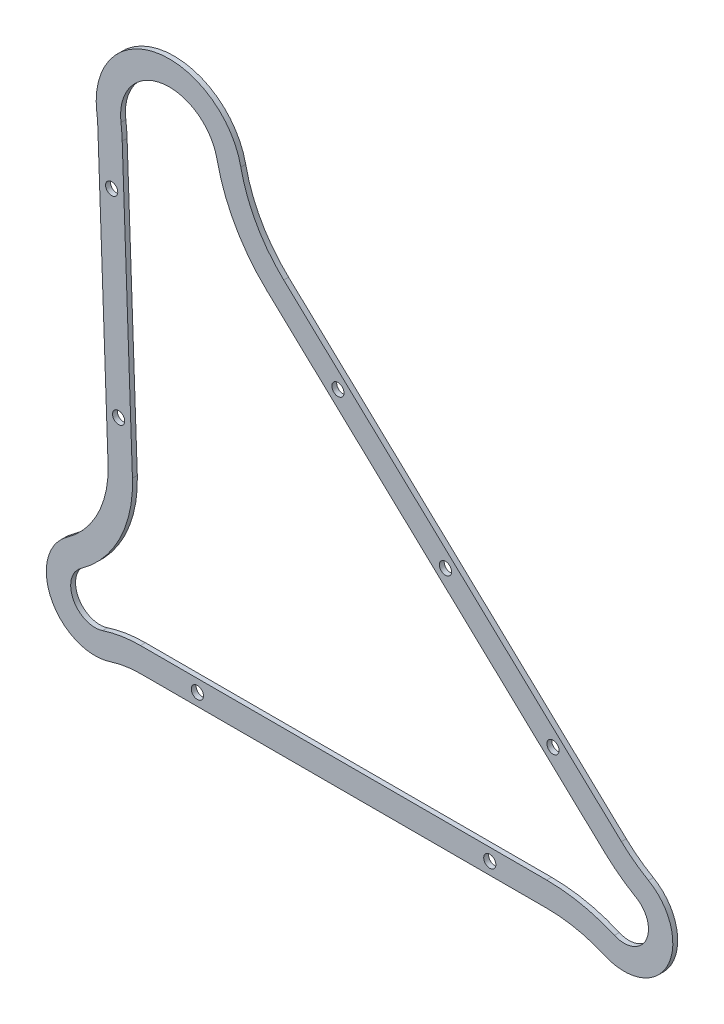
ISO-10303-21;
HEADER;
FILE_DESCRIPTION(('STEP AP214'),'2;1');
FILE_NAME('part.step','',(''),(''),'','','');
FILE_SCHEMA(('AUTOMOTIVE_DESIGN { 1 0 10303 214 1 1 1 1 }'));
ENDSEC;
DATA;
#1=APPLICATION_CONTEXT('core data for automotive mechanical design processes');
#2=APPLICATION_PROTOCOL_DEFINITION('international standard','automotive_design',2000,#1);
#3=PRODUCT_CONTEXT('',#1,'mechanical');
#4=PRODUCT('Part','Part','',(#3));
#5=PRODUCT_RELATED_PRODUCT_CATEGORY('part','',(#4));
#6=PRODUCT_DEFINITION_FORMATION('','',#4);
#7=PRODUCT_DEFINITION_CONTEXT('part definition',#1,'design');
#8=PRODUCT_DEFINITION('design','',#6,#7);
#9=PRODUCT_DEFINITION_SHAPE('','',#8);
#10=(LENGTH_UNIT() NAMED_UNIT(*) SI_UNIT(.MILLI.,.METRE.));
#11=(NAMED_UNIT(*) PLANE_ANGLE_UNIT() SI_UNIT($,.RADIAN.));
#12=(NAMED_UNIT(*) SI_UNIT($,.STERADIAN.) SOLID_ANGLE_UNIT());
#13=UNCERTAINTY_MEASURE_WITH_UNIT(LENGTH_MEASURE(1.E-05),#10,'distance_accuracy_value','');
#14=(GEOMETRIC_REPRESENTATION_CONTEXT(3) GLOBAL_UNCERTAINTY_ASSIGNED_CONTEXT((#13)) GLOBAL_UNIT_ASSIGNED_CONTEXT((#10,
#11,#12)) REPRESENTATION_CONTEXT('',''));
#15=CARTESIAN_POINT('',(0.,0.,0.));
#16=DIRECTION('',(0.,0.,1.));
#17=DIRECTION('',(1.,0.,0.));
#18=AXIS2_PLACEMENT_3D('',#15,#16,#17);
#19=CARTESIAN_POINT('',(65.3082975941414,-204.297699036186,2.54));
#20=DIRECTION('',(0.,0.,1.));
#21=DIRECTION('',(1.,0.,0.));
#22=AXIS2_PLACEMENT_3D('',#19,#20,#21);
#23=PLANE('',#22);
#24=CARTESIAN_POINT('',(-116.75036291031,-121.747699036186,2.54));
#25=DIRECTION('',(0.,0.,1.));
#26=DIRECTION('',(1.,0.,0.));
#27=AXIS2_PLACEMENT_3D('',#24,#25,#26);
#28=CIRCLE('',#27,3.175);
#29=CARTESIAN_POINT('',(-113.57536291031,-121.747699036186,2.54));
#30=VERTEX_POINT('',#29);
#31=EDGE_CURVE('E625',#30,#30,#28,.T.);
#32=ORIENTED_EDGE('',*,*,#31,.F.);
#33=EDGE_LOOP('',(#32));
#34=FACE_BOUND('',#33,.T.);
#35=CARTESIAN_POINT('',(35.6496370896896,-121.747699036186,2.54));
#36=DIRECTION('',(0.,0.,1.));
#37=DIRECTION('',(1.,0.,0.));
#38=AXIS2_PLACEMENT_3D('',#35,#36,#37);
#39=CIRCLE('',#38,3.175);
#40=CARTESIAN_POINT('',(38.8246370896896,-121.747699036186,2.54));
#41=VERTEX_POINT('',#40);
#42=EDGE_CURVE('E627',#41,#41,#39,.T.);
#43=ORIENTED_EDGE('',*,*,#42,.F.);
#44=EDGE_LOOP('',(#43));
#45=FACE_BOUND('',#44,.T.);
#46=CARTESIAN_POINT('',(68.5895734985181,-53.7640875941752,2.54));
#47=DIRECTION('',(0.,0.,1.));
#48=DIRECTION('',(1.,0.,0.));
#49=AXIS2_PLACEMENT_3D('',#46,#47,#48);
#50=CIRCLE('',#49,3.175);
#51=CARTESIAN_POINT('',(71.7645734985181,-53.7640875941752,2.54));
#52=VERTEX_POINT('',#51);
#53=EDGE_CURVE('E635',#52,#52,#50,.T.);
#54=ORIENTED_EDGE('',*,*,#53,.F.);
#55=EDGE_LOOP('',(#54));
#56=FACE_BOUND('',#55,.T.);
#57=CARTESIAN_POINT('',(12.5457813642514,-1.07212379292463,2.54));
#58=DIRECTION('',(0.,0.,1.));
#59=DIRECTION('',(1.,0.,0.));
#60=AXIS2_PLACEMENT_3D('',#57,#58,#59);
#61=CIRCLE('',#60,3.175);
#62=CARTESIAN_POINT('',(15.7207813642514,-1.07212379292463,2.54));
#63=VERTEX_POINT('',#62);
#64=EDGE_CURVE('E641',#63,#63,#61,.T.);
#65=ORIENTED_EDGE('',*,*,#64,.F.);
#66=EDGE_LOOP('',(#65));
#67=FACE_BOUND('',#66,.T.);
#68=CARTESIAN_POINT('',(-43.4980107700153,51.619840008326,2.54));
#69=DIRECTION('',(0.,0.,1.));
#70=DIRECTION('',(1.,0.,0.));
#71=AXIS2_PLACEMENT_3D('',#68,#69,#70);
#72=CIRCLE('',#71,3.175);
#73=CARTESIAN_POINT('',(-40.3230107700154,51.619840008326,2.54));
#74=VERTEX_POINT('',#73);
#75=EDGE_CURVE('E647',#74,#74,#72,.T.);
#76=ORIENTED_EDGE('',*,*,#75,.F.);
#77=EDGE_LOOP('',(#76));
#78=FACE_BOUND('',#77,.T.);
#79=CARTESIAN_POINT('',(-157.790709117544,-18.2212146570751,2.54));
#80=DIRECTION('',(0.,0.,1.));
#81=DIRECTION('',(1.,0.,0.));
#82=AXIS2_PLACEMENT_3D('',#79,#80,#81);
#83=CIRCLE('',#82,3.175);
#84=CARTESIAN_POINT('',(-154.615709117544,-18.2212146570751,2.54));
#85=VERTEX_POINT('',#84);
#86=EDGE_CURVE('E653',#85,#85,#83,.T.);
#87=ORIENTED_EDGE('',*,*,#86,.F.);
#88=EDGE_LOOP('',(#87));
#89=FACE_BOUND('',#88,.T.);
#90=CARTESIAN_POINT('',(-161.411524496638,83.3142456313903,2.54));
#91=DIRECTION('',(0.,0.,1.));
#92=DIRECTION('',(1.,0.,0.));
#93=AXIS2_PLACEMENT_3D('',#90,#91,#92);
#94=CIRCLE('',#93,3.175);
#95=CARTESIAN_POINT('',(-158.236524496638,83.3142456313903,2.54));
#96=VERTEX_POINT('',#95);
#97=EDGE_CURVE('E212',#96,#96,#94,.T.);
#98=ORIENTED_EDGE('',*,*,#97,.F.);
#99=EDGE_LOOP('',(#98));
#100=FACE_BOUND('',#99,.T.);
#101=CARTESIAN_POINT('',(65.3082975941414,-204.297699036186,2.54));
#102=DIRECTION('',(0.,0.,-1.));
#103=DIRECTION('',(1.,0.,0.));
#104=AXIS2_PLACEMENT_3D('',#101,#102,#103);
#105=CIRCLE('',#104,76.2);
#106=CARTESIAN_POINT('',(65.3082975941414,-128.097699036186,2.54));
#107=VERTEX_POINT('',#106);
#108=CARTESIAN_POINT('',(95.5634181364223,-134.361530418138,2.54));
#109=VERTEX_POINT('',#108);
#110=EDGE_CURVE('E308',#107,#109,#105,.T.);
#111=ORIENTED_EDGE('',*,*,#110,.T.);
#112=CARTESIAN_POINT('',(105.648458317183,-111.049474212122,2.54));
#113=DIRECTION('',(0.,0.,1.));
#114=DIRECTION('',(1.,0.,0.));
#115=AXIS2_PLACEMENT_3D('',#112,#113,#114);
#116=CIRCLE('',#115,25.4);
#117=CARTESIAN_POINT('',(118.34776621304,-89.052029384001,2.54));
#118=VERTEX_POINT('',#117);
#119=EDGE_CURVE('E311',#109,#118,#116,.T.);
#120=ORIENTED_EDGE('',*,*,#119,.T.);
#121=CARTESIAN_POINT('',(156.445689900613,-23.0596948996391,2.54));
#122=DIRECTION('',(0.,0.,-1.));
#123=DIRECTION('',(1.,0.,0.));
#124=AXIS2_PLACEMENT_3D('',#121,#122,#123);
#125=CIRCLE('',#124,76.2);
#126=CARTESIAN_POINT('',(104.249868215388,-78.5757844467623,2.54));
#127=VERTEX_POINT('',#126);
#128=EDGE_CURVE('E313',#118,#127,#125,.T.);
#129=ORIENTED_EDGE('',*,*,#128,.T.);
#130=DIRECTION('',(-0.728557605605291,0.684984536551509,0.));
#131=VECTOR('',#130,1.);
#132=CARTESIAN_POINT('',(104.249868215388,-78.5757844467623,2.54));
#133=LINE('',#132,#131);
#134=CARTESIAN_POINT('',(-71.7377864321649,86.8865223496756,2.54));
#135=VERTEX_POINT('',#134);
#136=EDGE_CURVE('E315',#127,#135,#133,.T.);
#137=ORIENTED_EDGE('',*,*,#136,.T.);
#138=CARTESIAN_POINT('',(-19.5419647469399,142.402611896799,2.54));
#139=DIRECTION('',(0.,0.,-1.));
#140=DIRECTION('',(1.,0.,0.));
#141=AXIS2_PLACEMENT_3D('',#138,#139,#140);
#142=CIRCLE('',#141,76.2);
#143=CARTESIAN_POINT('',(-94.1045384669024,126.690750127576,2.54));
#144=VERTEX_POINT('',#143);
#145=EDGE_CURVE('E317',#135,#144,#142,.T.);
#146=ORIENTED_EDGE('',*,*,#145,.T.);
#147=CARTESIAN_POINT('',(-131.385825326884,118.834819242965,2.54));
#148=DIRECTION('',(0.,0.,1.));
#149=DIRECTION('',(1.,0.,0.));
#150=AXIS2_PLACEMENT_3D('',#147,#148,#149);
#151=CIRCLE('',#150,38.1);
#152=CARTESIAN_POINT('',(-169.178577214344,114.005957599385,2.54));
#153=VERTEX_POINT('',#152);
#154=EDGE_CURVE('E319',#144,#153,#151,.T.);
#155=ORIENTED_EDGE('',*,*,#154,.T.);
#156=CARTESIAN_POINT('',(-244.764080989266,104.348234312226,2.54));
#157=DIRECTION('',(0.,0.,-1.));
#158=DIRECTION('',(1.,0.,0.));
#159=AXIS2_PLACEMENT_3D('',#156,#157,#158);
#160=CIRCLE('',#159,76.2);
#161=CARTESIAN_POINT('',(-168.612485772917,107.063845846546,2.54));
#162=VERTEX_POINT('',#161);
#163=EDGE_CURVE('E321',#153,#162,#160,.T.);
#164=ORIENTED_EDGE('',*,*,#163,.T.);
#165=DIRECTION('',(0.0356379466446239,-0.999364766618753,0.));
#166=VECTOR('',#165,1.);
#167=CARTESIAN_POINT('',(-168.612485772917,107.063845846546,2.54));
#168=LINE('',#167,#166);
#169=CARTESIAN_POINT('',(-163.281680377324,-42.4234167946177,2.54));
#170=VERTEX_POINT('',#169);
#171=EDGE_CURVE('E323',#162,#170,#168,.T.);
#172=ORIENTED_EDGE('',*,*,#171,.T.);
#173=CARTESIAN_POINT('',(-214.049410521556,-44.2338244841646,2.54));
#174=DIRECTION('',(0.,0.,-1.));
#175=DIRECTION('',(1.,0.,0.));
#176=AXIS2_PLACEMENT_3D('',#173,#174,#175);
#177=CIRCLE('',#176,50.8);
#178=CARTESIAN_POINT('',(-184.735159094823,-85.7225538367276,2.54));
#179=VERTEX_POINT('',#178);
#180=EDGE_CURVE('E325',#170,#179,#177,.T.);
#181=ORIENTED_EDGE('',*,*,#180,.T.);
#182=CARTESIAN_POINT('',(-170.078033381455,-106.466918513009,2.54));
#183=DIRECTION('',(0.,0.,1.));
#184=DIRECTION('',(1.,0.,0.));
#185=AXIS2_PLACEMENT_3D('',#182,#183,#184);
#186=CIRCLE('',#185,25.4);
#187=CARTESIAN_POINT('',(-162.188363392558,-130.610512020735,2.54));
#188=VERTEX_POINT('',#187);
#189=EDGE_CURVE('E327',#179,#188,#186,.T.);
#190=ORIENTED_EDGE('',*,*,#189,.T.);
#191=CARTESIAN_POINT('',(-146.409023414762,-178.897699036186,2.54));
#192=DIRECTION('',(0.,0.,-1.));
#193=DIRECTION('',(1.,0.,0.));
#194=AXIS2_PLACEMENT_3D('',#191,#192,#193);
#195=CIRCLE('',#194,50.8);
#196=CARTESIAN_POINT('',(-146.409023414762,-128.097699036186,2.54));
#197=VERTEX_POINT('',#196);
#198=EDGE_CURVE('E329',#188,#197,#195,.T.);
#199=ORIENTED_EDGE('',*,*,#198,.T.);
#200=DIRECTION('',(1.,0.,0.));
#201=VECTOR('',#200,1.);
#202=CARTESIAN_POINT('',(-146.409023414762,-128.097699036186,2.54));
#203=LINE('',#202,#201);
#204=EDGE_CURVE('E331',#197,#107,#203,.T.);
#205=ORIENTED_EDGE('',*,*,#204,.T.);
#206=EDGE_LOOP('',(#111,#120,#129,#137,#146,#155,#164,#172,#181,#190,#199,#205));
#207=FACE_BOUND('',#206,.T.);
#208=DIRECTION('',(1.,0.,0.));
#209=VECTOR('',#208,1.);
#210=CARTESIAN_POINT('',(-146.409023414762,-115.397699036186,2.54));
#211=LINE('',#210,#209);
#212=CARTESIAN_POINT('',(-146.409023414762,-115.397699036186,2.54));
#213=VERTEX_POINT('',#212);
#214=CARTESIAN_POINT('',(65.3082975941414,-115.397699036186,2.54));
#215=VERTEX_POINT('',#214);
#216=EDGE_CURVE('E242',#213,#215,#211,.T.);
#217=ORIENTED_EDGE('',*,*,#216,.F.);
#218=CARTESIAN_POINT('',(-146.409023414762,-178.897699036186,2.54));
#219=DIRECTION('',(0.,0.,-1.));
#220=DIRECTION('',(1.,0.,0.));
#221=AXIS2_PLACEMENT_3D('',#218,#219,#220);
#222=CIRCLE('',#221,63.5);
#223=CARTESIAN_POINT('',(-166.133198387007,-118.538715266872,2.54));
#224=VERTEX_POINT('',#223);
#225=EDGE_CURVE('E202',#224,#213,#222,.T.);
#226=ORIENTED_EDGE('',*,*,#225,.F.);
#227=CARTESIAN_POINT('',(-170.078033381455,-106.466918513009,2.54));
#228=DIRECTION('',(0.,0.,1.));
#229=DIRECTION('',(1.,0.,0.));
#230=AXIS2_PLACEMENT_3D('',#227,#228,#229);
#231=CIRCLE('',#230,12.7);
#232=CARTESIAN_POINT('',(-177.406596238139,-96.0947361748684,2.54));
#233=VERTEX_POINT('',#232);
#234=EDGE_CURVE('E262',#233,#224,#231,.T.);
#235=ORIENTED_EDGE('',*,*,#234,.F.);
#236=CARTESIAN_POINT('',(-214.049410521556,-44.2338244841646,2.54));
#237=DIRECTION('',(0.,0.,-1.));
#238=DIRECTION('',(1.,0.,0.));
#239=AXIS2_PLACEMENT_3D('',#236,#237,#238);
#240=CIRCLE('',#239,63.5);
#241=CARTESIAN_POINT('',(-150.589747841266,-41.970814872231,2.54));
#242=VERTEX_POINT('',#241);
#243=EDGE_CURVE('E260',#242,#233,#240,.T.);
#244=ORIENTED_EDGE('',*,*,#243,.F.);
#245=DIRECTION('',(0.0356379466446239,-0.999364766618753,0.));
#246=VECTOR('',#245,1.);
#247=CARTESIAN_POINT('',(-155.920553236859,107.516447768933,2.54));
#248=LINE('',#247,#246);
#249=CARTESIAN_POINT('',(-155.920553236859,107.516447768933,2.54));
#250=VERTEX_POINT('',#249);
#251=EDGE_CURVE('E258',#250,#242,#248,.T.);
#252=ORIENTED_EDGE('',*,*,#251,.F.);
#253=CARTESIAN_POINT('',(-244.764080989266,104.348234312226,2.54));
#254=DIRECTION('',(0.,0.,-1.));
#255=DIRECTION('',(1.,0.,0.));
#256=AXIS2_PLACEMENT_3D('',#253,#254,#255);
#257=CIRCLE('',#256,88.9);
#258=CARTESIAN_POINT('',(-156.580993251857,115.615578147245,2.54));
#259=VERTEX_POINT('',#258);
#260=EDGE_CURVE('E256',#259,#250,#257,.T.);
#261=ORIENTED_EDGE('',*,*,#260,.F.);
#262=CARTESIAN_POINT('',(-131.385825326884,118.834819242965,2.54));
#263=DIRECTION('',(0.,0.,1.));
#264=DIRECTION('',(1.,0.,0.));
#265=AXIS2_PLACEMENT_3D('',#262,#263,#264);
#266=CIRCLE('',#265,25.4);
#267=CARTESIAN_POINT('',(-106.531634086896,124.072106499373,2.54));
#268=VERTEX_POINT('',#267);
#269=EDGE_CURVE('E254',#268,#259,#266,.T.);
#270=ORIENTED_EDGE('',*,*,#269,.F.);
#271=CARTESIAN_POINT('',(-19.5419647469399,142.402611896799,2.54));
#272=DIRECTION('',(0.,0.,-1.));
#273=DIRECTION('',(1.,0.,0.));
#274=AXIS2_PLACEMENT_3D('',#271,#272,#273);
#275=CIRCLE('',#274,88.9);
#276=CARTESIAN_POINT('',(-80.4370900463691,77.6338407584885,2.54));
#277=VERTEX_POINT('',#276);
#278=EDGE_CURVE('E252',#277,#268,#275,.T.);
#279=ORIENTED_EDGE('',*,*,#278,.F.);
#280=DIRECTION('',(-0.728557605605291,0.684984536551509,0.));
#281=VECTOR('',#280,1.);
#282=CARTESIAN_POINT('',(95.5505646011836,-87.8284660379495,2.54));
#283=LINE('',#282,#281);
#284=CARTESIAN_POINT('',(95.5505646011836,-87.8284660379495,2.54));
#285=VERTEX_POINT('',#284);
#286=EDGE_CURVE('E250',#285,#277,#283,.T.);
#287=ORIENTED_EDGE('',*,*,#286,.F.);
#288=CARTESIAN_POINT('',(156.445689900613,-23.0596948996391,2.54));
#289=DIRECTION('',(0.,0.,-1.));
#290=DIRECTION('',(1.,0.,0.));
#291=AXIS2_PLACEMENT_3D('',#288,#289,#290);
#292=CIRCLE('',#291,88.9);
#293=CARTESIAN_POINT('',(111.998112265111,-100.050751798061,2.54));
#294=VERTEX_POINT('',#293);
#295=EDGE_CURVE('E248',#294,#285,#292,.T.);
#296=ORIENTED_EDGE('',*,*,#295,.F.);
#297=CARTESIAN_POINT('',(105.648458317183,-111.049474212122,2.54));
#298=DIRECTION('',(0.,0.,1.));
#299=DIRECTION('',(1.,0.,0.));
#300=AXIS2_PLACEMENT_3D('',#297,#298,#299);
#301=CIRCLE('',#300,12.7);
#302=CARTESIAN_POINT('',(100.605938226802,-122.70550231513,2.54));
#303=VERTEX_POINT('',#302);
#304=EDGE_CURVE('E246',#303,#294,#301,.T.);
#305=ORIENTED_EDGE('',*,*,#304,.F.);
#306=CARTESIAN_POINT('',(65.3082975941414,-204.297699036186,2.54));
#307=DIRECTION('',(0.,0.,-1.));
#308=DIRECTION('',(1.,0.,0.));
#309=AXIS2_PLACEMENT_3D('',#306,#307,#308);
#310=CIRCLE('',#309,88.9);
#311=EDGE_CURVE('E244',#215,#303,#310,.T.);
#312=ORIENTED_EDGE('',*,*,#311,.F.);
#313=EDGE_LOOP('',(#217,#226,#235,#244,#252,#261,#270,#279,#287,#296,#305,#312));
#314=FACE_BOUND('',#313,.T.);
#315=ADVANCED_FACE('F26',(#34,#45,#56,#67,#78,#89,#100,#207,#314),#23,.T.);
#316=CARTESIAN_POINT('',(65.3082975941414,-204.297699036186,0.));
#317=DIRECTION('',(0.,0.,1.));
#318=DIRECTION('',(1.,0.,0.));
#319=AXIS2_PLACEMENT_3D('',#316,#317,#318);
#320=PLANE('',#319);
#321=CARTESIAN_POINT('',(-116.75036291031,-121.747699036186,0.));
#322=DIRECTION('',(0.,0.,1.));
#323=DIRECTION('',(1.,0.,0.));
#324=AXIS2_PLACEMENT_3D('',#321,#322,#323);
#325=CIRCLE('',#324,3.175);
#326=CARTESIAN_POINT('',(-113.57536291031,-121.747699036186,0.));
#327=VERTEX_POINT('',#326);
#328=EDGE_CURVE('E623',#327,#327,#325,.T.);
#329=ORIENTED_EDGE('',*,*,#328,.T.);
#330=EDGE_LOOP('',(#329));
#331=FACE_BOUND('',#330,.T.);
#332=CARTESIAN_POINT('',(35.6496370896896,-121.747699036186,0.));
#333=DIRECTION('',(0.,0.,1.));
#334=DIRECTION('',(1.,0.,0.));
#335=AXIS2_PLACEMENT_3D('',#332,#333,#334);
#336=CIRCLE('',#335,3.175);
#337=CARTESIAN_POINT('',(38.8246370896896,-121.747699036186,0.));
#338=VERTEX_POINT('',#337);
#339=EDGE_CURVE('E632',#338,#338,#336,.T.);
#340=ORIENTED_EDGE('',*,*,#339,.T.);
#341=EDGE_LOOP('',(#340));
#342=FACE_BOUND('',#341,.T.);
#343=CARTESIAN_POINT('',(68.5895734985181,-53.7640875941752,0.));
#344=DIRECTION('',(0.,0.,1.));
#345=DIRECTION('',(1.,0.,0.));
#346=AXIS2_PLACEMENT_3D('',#343,#344,#345);
#347=CIRCLE('',#346,3.175);
#348=CARTESIAN_POINT('',(71.7645734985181,-53.7640875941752,0.));
#349=VERTEX_POINT('',#348);
#350=EDGE_CURVE('E638',#349,#349,#347,.T.);
#351=ORIENTED_EDGE('',*,*,#350,.T.);
#352=EDGE_LOOP('',(#351));
#353=FACE_BOUND('',#352,.T.);
#354=CARTESIAN_POINT('',(12.5457813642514,-1.07212379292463,0.));
#355=DIRECTION('',(0.,0.,1.));
#356=DIRECTION('',(1.,0.,0.));
#357=AXIS2_PLACEMENT_3D('',#354,#355,#356);
#358=CIRCLE('',#357,3.175);
#359=CARTESIAN_POINT('',(15.7207813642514,-1.07212379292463,0.));
#360=VERTEX_POINT('',#359);
#361=EDGE_CURVE('E644',#360,#360,#358,.T.);
#362=ORIENTED_EDGE('',*,*,#361,.T.);
#363=EDGE_LOOP('',(#362));
#364=FACE_BOUND('',#363,.T.);
#365=CARTESIAN_POINT('',(-43.4980107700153,51.619840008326,0.));
#366=DIRECTION('',(0.,0.,1.));
#367=DIRECTION('',(1.,0.,0.));
#368=AXIS2_PLACEMENT_3D('',#365,#366,#367);
#369=CIRCLE('',#368,3.175);
#370=CARTESIAN_POINT('',(-40.3230107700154,51.619840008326,0.));
#371=VERTEX_POINT('',#370);
#372=EDGE_CURVE('E650',#371,#371,#369,.T.);
#373=ORIENTED_EDGE('',*,*,#372,.T.);
#374=EDGE_LOOP('',(#373));
#375=FACE_BOUND('',#374,.T.);
#376=CARTESIAN_POINT('',(-157.790709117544,-18.2212146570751,0.));
#377=DIRECTION('',(0.,0.,1.));
#378=DIRECTION('',(1.,0.,0.));
#379=AXIS2_PLACEMENT_3D('',#376,#377,#378);
#380=CIRCLE('',#379,3.175);
#381=CARTESIAN_POINT('',(-154.615709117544,-18.2212146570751,0.));
#382=VERTEX_POINT('',#381);
#383=EDGE_CURVE('E656',#382,#382,#380,.T.);
#384=ORIENTED_EDGE('',*,*,#383,.T.);
#385=EDGE_LOOP('',(#384));
#386=FACE_BOUND('',#385,.T.);
#387=CARTESIAN_POINT('',(-161.411524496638,83.3142456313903,0.));
#388=DIRECTION('',(0.,0.,1.));
#389=DIRECTION('',(1.,0.,0.));
#390=AXIS2_PLACEMENT_3D('',#387,#388,#389);
#391=CIRCLE('',#390,3.175);
#392=CARTESIAN_POINT('',(-158.236524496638,83.3142456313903,0.));
#393=VERTEX_POINT('',#392);
#394=EDGE_CURVE('E209',#393,#393,#391,.T.);
#395=ORIENTED_EDGE('',*,*,#394,.T.);
#396=EDGE_LOOP('',(#395));
#397=FACE_BOUND('',#396,.T.);
#398=CARTESIAN_POINT('',(65.3082975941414,-204.297699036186,0.));
#399=DIRECTION('',(0.,0.,-1.));
#400=DIRECTION('',(1.,0.,0.));
#401=AXIS2_PLACEMENT_3D('',#398,#399,#400);
#402=CIRCLE('',#401,76.2);
#403=CARTESIAN_POINT('',(65.3082975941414,-128.097699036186,0.));
#404=VERTEX_POINT('',#403);
#405=CARTESIAN_POINT('',(95.5634181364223,-134.361530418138,0.));
#406=VERTEX_POINT('',#405);
#407=EDGE_CURVE('E203',#404,#406,#402,.T.);
#408=ORIENTED_EDGE('',*,*,#407,.F.);
#409=DIRECTION('',(1.,0.,0.));
#410=VECTOR('',#409,1.);
#411=CARTESIAN_POINT('',(-146.409023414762,-128.097699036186,0.));
#412=LINE('',#411,#410);
#413=CARTESIAN_POINT('',(-146.409023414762,-128.097699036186,0.));
#414=VERTEX_POINT('',#413);
#415=EDGE_CURVE('E306',#414,#404,#412,.T.);
#416=ORIENTED_EDGE('',*,*,#415,.F.);
#417=CARTESIAN_POINT('',(-146.409023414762,-178.897699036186,0.));
#418=DIRECTION('',(0.,0.,-1.));
#419=DIRECTION('',(1.,0.,0.));
#420=AXIS2_PLACEMENT_3D('',#417,#418,#419);
#421=CIRCLE('',#420,50.8);
#422=CARTESIAN_POINT('',(-162.188363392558,-130.610512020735,0.));
#423=VERTEX_POINT('',#422);
#424=EDGE_CURVE('E304',#423,#414,#421,.T.);
#425=ORIENTED_EDGE('',*,*,#424,.F.);
#426=CARTESIAN_POINT('',(-170.078033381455,-106.466918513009,0.));
#427=DIRECTION('',(0.,0.,1.));
#428=DIRECTION('',(1.,0.,0.));
#429=AXIS2_PLACEMENT_3D('',#426,#427,#428);
#430=CIRCLE('',#429,25.4);
#431=CARTESIAN_POINT('',(-184.735159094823,-85.7225538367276,0.));
#432=VERTEX_POINT('',#431);
#433=EDGE_CURVE('E302',#432,#423,#430,.T.);
#434=ORIENTED_EDGE('',*,*,#433,.F.);
#435=CARTESIAN_POINT('',(-214.049410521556,-44.2338244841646,0.));
#436=DIRECTION('',(0.,0.,-1.));
#437=DIRECTION('',(1.,0.,0.));
#438=AXIS2_PLACEMENT_3D('',#435,#436,#437);
#439=CIRCLE('',#438,50.8);
#440=CARTESIAN_POINT('',(-163.281680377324,-42.4234167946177,0.));
#441=VERTEX_POINT('',#440);
#442=EDGE_CURVE('E300',#441,#432,#439,.T.);
#443=ORIENTED_EDGE('',*,*,#442,.F.);
#444=DIRECTION('',(0.0356379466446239,-0.999364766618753,0.));
#445=VECTOR('',#444,1.);
#446=CARTESIAN_POINT('',(-168.612485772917,107.063845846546,0.));
#447=LINE('',#446,#445);
#448=CARTESIAN_POINT('',(-168.612485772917,107.063845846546,0.));
#449=VERTEX_POINT('',#448);
#450=EDGE_CURVE('E298',#449,#441,#447,.T.);
#451=ORIENTED_EDGE('',*,*,#450,.F.);
#452=CARTESIAN_POINT('',(-244.764080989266,104.348234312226,0.));
#453=DIRECTION('',(0.,0.,-1.));
#454=DIRECTION('',(1.,0.,0.));
#455=AXIS2_PLACEMENT_3D('',#452,#453,#454);
#456=CIRCLE('',#455,76.2);
#457=CARTESIAN_POINT('',(-169.178577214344,114.005957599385,0.));
#458=VERTEX_POINT('',#457);
#459=EDGE_CURVE('E296',#458,#449,#456,.T.);
#460=ORIENTED_EDGE('',*,*,#459,.F.);
#461=CARTESIAN_POINT('',(-131.385825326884,118.834819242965,0.));
#462=DIRECTION('',(0.,0.,1.));
#463=DIRECTION('',(1.,0.,0.));
#464=AXIS2_PLACEMENT_3D('',#461,#462,#463);
#465=CIRCLE('',#464,38.1);
#466=CARTESIAN_POINT('',(-94.1045384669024,126.690750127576,0.));
#467=VERTEX_POINT('',#466);
#468=EDGE_CURVE('E294',#467,#458,#465,.T.);
#469=ORIENTED_EDGE('',*,*,#468,.F.);
#470=CARTESIAN_POINT('',(-19.5419647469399,142.402611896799,0.));
#471=DIRECTION('',(0.,0.,-1.));
#472=DIRECTION('',(1.,0.,0.));
#473=AXIS2_PLACEMENT_3D('',#470,#471,#472);
#474=CIRCLE('',#473,76.2);
#475=CARTESIAN_POINT('',(-71.7377864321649,86.8865223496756,0.));
#476=VERTEX_POINT('',#475);
#477=EDGE_CURVE('E292',#476,#467,#474,.T.);
#478=ORIENTED_EDGE('',*,*,#477,.F.);
#479=DIRECTION('',(-0.728557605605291,0.684984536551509,0.));
#480=VECTOR('',#479,1.);
#481=CARTESIAN_POINT('',(104.249868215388,-78.5757844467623,0.));
#482=LINE('',#481,#480);
#483=CARTESIAN_POINT('',(104.249868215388,-78.5757844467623,0.));
#484=VERTEX_POINT('',#483);
#485=EDGE_CURVE('E290',#484,#476,#482,.T.);
#486=ORIENTED_EDGE('',*,*,#485,.F.);
#487=CARTESIAN_POINT('',(156.445689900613,-23.0596948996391,0.));
#488=DIRECTION('',(0.,0.,-1.));
#489=DIRECTION('',(1.,0.,0.));
#490=AXIS2_PLACEMENT_3D('',#487,#488,#489);
#491=CIRCLE('',#490,76.2);
#492=CARTESIAN_POINT('',(118.34776621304,-89.052029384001,0.));
#493=VERTEX_POINT('',#492);
#494=EDGE_CURVE('E288',#493,#484,#491,.T.);
#495=ORIENTED_EDGE('',*,*,#494,.F.);
#496=CARTESIAN_POINT('',(105.648458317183,-111.049474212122,0.));
#497=DIRECTION('',(0.,0.,1.));
#498=DIRECTION('',(1.,0.,0.));
#499=AXIS2_PLACEMENT_3D('',#496,#497,#498);
#500=CIRCLE('',#499,25.4);
#501=EDGE_CURVE('E286',#406,#493,#500,.T.);
#502=ORIENTED_EDGE('',*,*,#501,.F.);
#503=EDGE_LOOP('',(#408,#416,#425,#434,#443,#451,#460,#469,#478,#486,#495,#502));
#504=FACE_BOUND('',#503,.T.);
#505=CARTESIAN_POINT('',(-146.409023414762,-178.897699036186,0.));
#506=DIRECTION('',(0.,0.,-1.));
#507=DIRECTION('',(1.,0.,0.));
#508=AXIS2_PLACEMENT_3D('',#505,#506,#507);
#509=CIRCLE('',#508,63.5);
#510=CARTESIAN_POINT('',(-166.133198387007,-118.538715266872,0.));
#511=VERTEX_POINT('',#510);
#512=CARTESIAN_POINT('',(-146.409023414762,-115.397699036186,0.));
#513=VERTEX_POINT('',#512);
#514=EDGE_CURVE('E49',#511,#513,#509,.T.);
#515=ORIENTED_EDGE('',*,*,#514,.T.);
#516=DIRECTION('',(1.,0.,0.));
#517=VECTOR('',#516,1.);
#518=CARTESIAN_POINT('',(-146.409023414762,-115.397699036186,0.));
#519=LINE('',#518,#517);
#520=CARTESIAN_POINT('',(65.3082975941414,-115.397699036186,0.));
#521=VERTEX_POINT('',#520);
#522=EDGE_CURVE('E189',#513,#521,#519,.T.);
#523=ORIENTED_EDGE('',*,*,#522,.T.);
#524=CARTESIAN_POINT('',(65.3082975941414,-204.297699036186,0.));
#525=DIRECTION('',(0.,0.,-1.));
#526=DIRECTION('',(1.,0.,0.));
#527=AXIS2_PLACEMENT_3D('',#524,#525,#526);
#528=CIRCLE('',#527,88.9);
#529=CARTESIAN_POINT('',(100.605938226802,-122.70550231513,0.));
#530=VERTEX_POINT('',#529);
#531=EDGE_CURVE('E198',#521,#530,#528,.T.);
#532=ORIENTED_EDGE('',*,*,#531,.T.);
#533=CARTESIAN_POINT('',(105.648458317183,-111.049474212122,0.));
#534=DIRECTION('',(0.,0.,1.));
#535=DIRECTION('',(1.,0.,0.));
#536=AXIS2_PLACEMENT_3D('',#533,#534,#535);
#537=CIRCLE('',#536,12.7);
#538=CARTESIAN_POINT('',(111.998112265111,-100.050751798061,0.));
#539=VERTEX_POINT('',#538);
#540=EDGE_CURVE('E217',#530,#539,#537,.T.);
#541=ORIENTED_EDGE('',*,*,#540,.T.);
#542=CARTESIAN_POINT('',(156.445689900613,-23.0596948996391,0.));
#543=DIRECTION('',(0.,0.,-1.));
#544=DIRECTION('',(1.,0.,0.));
#545=AXIS2_PLACEMENT_3D('',#542,#543,#544);
#546=CIRCLE('',#545,88.9);
#547=CARTESIAN_POINT('',(95.5505646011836,-87.8284660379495,0.));
#548=VERTEX_POINT('',#547);
#549=EDGE_CURVE('E220',#539,#548,#546,.T.);
#550=ORIENTED_EDGE('',*,*,#549,.T.);
#551=DIRECTION('',(-0.728557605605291,0.684984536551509,0.));
#552=VECTOR('',#551,1.);
#553=CARTESIAN_POINT('',(95.5505646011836,-87.8284660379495,0.));
#554=LINE('',#553,#552);
#555=CARTESIAN_POINT('',(-80.4370900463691,77.6338407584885,0.));
#556=VERTEX_POINT('',#555);
#557=EDGE_CURVE('E223',#548,#556,#554,.T.);
#558=ORIENTED_EDGE('',*,*,#557,.T.);
#559=CARTESIAN_POINT('',(-19.5419647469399,142.402611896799,0.));
#560=DIRECTION('',(0.,0.,-1.));
#561=DIRECTION('',(1.,0.,0.));
#562=AXIS2_PLACEMENT_3D('',#559,#560,#561);
#563=CIRCLE('',#562,88.9);
#564=CARTESIAN_POINT('',(-106.531634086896,124.072106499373,0.));
#565=VERTEX_POINT('',#564);
#566=EDGE_CURVE('E226',#556,#565,#563,.T.);
#567=ORIENTED_EDGE('',*,*,#566,.T.);
#568=CARTESIAN_POINT('',(-131.385825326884,118.834819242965,0.));
#569=DIRECTION('',(0.,0.,1.));
#570=DIRECTION('',(1.,0.,0.));
#571=AXIS2_PLACEMENT_3D('',#568,#569,#570);
#572=CIRCLE('',#571,25.4);
#573=CARTESIAN_POINT('',(-156.580993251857,115.615578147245,0.));
#574=VERTEX_POINT('',#573);
#575=EDGE_CURVE('E229',#565,#574,#572,.T.);
#576=ORIENTED_EDGE('',*,*,#575,.T.);
#577=CARTESIAN_POINT('',(-244.764080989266,104.348234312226,0.));
#578=DIRECTION('',(0.,0.,-1.));
#579=DIRECTION('',(1.,0.,0.));
#580=AXIS2_PLACEMENT_3D('',#577,#578,#579);
#581=CIRCLE('',#580,88.9);
#582=CARTESIAN_POINT('',(-155.920553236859,107.516447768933,0.));
#583=VERTEX_POINT('',#582);
#584=EDGE_CURVE('E232',#574,#583,#581,.T.);
#585=ORIENTED_EDGE('',*,*,#584,.T.);
#586=DIRECTION('',(0.0356379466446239,-0.999364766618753,0.));
#587=VECTOR('',#586,1.);
#588=CARTESIAN_POINT('',(-155.920553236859,107.516447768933,0.));
#589=LINE('',#588,#587);
#590=CARTESIAN_POINT('',(-150.589747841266,-41.970814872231,0.));
#591=VERTEX_POINT('',#590);
#592=EDGE_CURVE('E235',#583,#591,#589,.T.);
#593=ORIENTED_EDGE('',*,*,#592,.T.);
#594=CARTESIAN_POINT('',(-214.049410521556,-44.2338244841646,0.));
#595=DIRECTION('',(0.,0.,-1.));
#596=DIRECTION('',(1.,0.,0.));
#597=AXIS2_PLACEMENT_3D('',#594,#595,#596);
#598=CIRCLE('',#597,63.5);
#599=CARTESIAN_POINT('',(-177.406596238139,-96.0947361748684,0.));
#600=VERTEX_POINT('',#599);
#601=EDGE_CURVE('E238',#591,#600,#598,.T.);
#602=ORIENTED_EDGE('',*,*,#601,.T.);
#603=CARTESIAN_POINT('',(-170.078033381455,-106.466918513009,0.));
#604=DIRECTION('',(0.,0.,1.));
#605=DIRECTION('',(1.,0.,0.));
#606=AXIS2_PLACEMENT_3D('',#603,#604,#605);
#607=CIRCLE('',#606,12.7);
#608=EDGE_CURVE('E208',#600,#511,#607,.T.);
#609=ORIENTED_EDGE('',*,*,#608,.T.);
#610=EDGE_LOOP('',(#515,#523,#532,#541,#550,#558,#567,#576,#585,#593,#602,#609));
#611=FACE_BOUND('',#610,.T.);
#612=ADVANCED_FACE('F206',(#331,#342,#353,#364,#375,#386,#397,#504,#611),#320,.F.);
#613=CARTESIAN_POINT('',(65.3082975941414,-204.297699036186,2.54));
#614=DIRECTION('',(0.,0.,-1.));
#615=DIRECTION('',(-1.,0.,0.));
#616=AXIS2_PLACEMENT_3D('',#613,#614,#615);
#617=CYLINDRICAL_SURFACE('',#616,76.2);
#618=ORIENTED_EDGE('',*,*,#407,.T.);
#619=DIRECTION('',(0.,0.,-1.));
#620=VECTOR('',#619,1.);
#621=CARTESIAN_POINT('',(95.5634181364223,-134.361530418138,2.54));
#622=LINE('',#621,#620);
#623=EDGE_CURVE('E11',#109,#406,#622,.T.);
#624=ORIENTED_EDGE('',*,*,#623,.F.);
#625=ORIENTED_EDGE('',*,*,#110,.F.);
#626=DIRECTION('',(0.,0.,-1.));
#627=VECTOR('',#626,1.);
#628=CARTESIAN_POINT('',(65.3082975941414,-128.097699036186,2.54));
#629=LINE('',#628,#627);
#630=EDGE_CURVE('E333',#107,#404,#629,.T.);
#631=ORIENTED_EDGE('',*,*,#630,.T.);
#632=EDGE_LOOP('',(#618,#624,#625,#631));
#633=FACE_BOUND('',#632,.T.);
#634=ADVANCED_FACE('F28',(#633),#617,.F.);
#635=CARTESIAN_POINT('',(105.648458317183,-111.049474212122,2.54));
#636=DIRECTION('',(0.,0.,-1.));
#637=DIRECTION('',(-1.,0.,0.));
#638=AXIS2_PLACEMENT_3D('',#635,#636,#637);
#639=CYLINDRICAL_SURFACE('',#638,25.4);
#640=ORIENTED_EDGE('',*,*,#501,.T.);
#641=DIRECTION('',(0.,0.,-1.));
#642=VECTOR('',#641,1.);
#643=CARTESIAN_POINT('',(118.34776621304,-89.052029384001,2.54));
#644=LINE('',#643,#642);
#645=EDGE_CURVE('E34',#118,#493,#644,.T.);
#646=ORIENTED_EDGE('',*,*,#645,.F.);
#647=ORIENTED_EDGE('',*,*,#119,.F.);
#648=ORIENTED_EDGE('',*,*,#623,.T.);
#649=EDGE_LOOP('',(#640,#646,#647,#648));
#650=FACE_BOUND('',#649,.T.);
#651=ADVANCED_FACE('F389',(#650),#639,.T.);
#652=CARTESIAN_POINT('',(156.445689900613,-23.0596948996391,2.54));
#653=DIRECTION('',(0.,0.,-1.));
#654=DIRECTION('',(-1.,0.,0.));
#655=AXIS2_PLACEMENT_3D('',#652,#653,#654);
#656=CYLINDRICAL_SURFACE('',#655,76.2);
#657=ORIENTED_EDGE('',*,*,#494,.T.);
#658=DIRECTION('',(0.,0.,-1.));
#659=VECTOR('',#658,1.);
#660=CARTESIAN_POINT('',(104.249868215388,-78.5757844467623,2.54));
#661=LINE('',#660,#659);
#662=EDGE_CURVE('E360',#127,#484,#661,.T.);
#663=ORIENTED_EDGE('',*,*,#662,.F.);
#664=ORIENTED_EDGE('',*,*,#128,.F.);
#665=ORIENTED_EDGE('',*,*,#645,.T.);
#666=EDGE_LOOP('',(#657,#663,#664,#665));
#667=FACE_BOUND('',#666,.T.);
#668=ADVANCED_FACE('F367',(#667),#656,.F.);
#669=CARTESIAN_POINT('',(104.249868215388,-78.5757844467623,2.54));
#670=DIRECTION('',(-0.684984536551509,-0.728557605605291,0.));
#671=DIRECTION('',(0.728557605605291,-0.684984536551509,0.));
#672=AXIS2_PLACEMENT_3D('',#669,#670,#671);
#673=PLANE('',#672);
#674=ORIENTED_EDGE('',*,*,#485,.T.);
#675=DIRECTION('',(0.,0.,-1.));
#676=VECTOR('',#675,1.);
#677=CARTESIAN_POINT('',(-71.7377864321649,86.8865223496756,2.54));
#678=LINE('',#677,#676);
#679=EDGE_CURVE('E357',#135,#476,#678,.T.);
#680=ORIENTED_EDGE('',*,*,#679,.F.);
#681=ORIENTED_EDGE('',*,*,#136,.F.);
#682=ORIENTED_EDGE('',*,*,#662,.T.);
#683=EDGE_LOOP('',(#674,#680,#681,#682));
#684=FACE_BOUND('',#683,.T.);
#685=ADVANCED_FACE('F377',(#684),#673,.F.);
#686=CARTESIAN_POINT('',(-19.5419647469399,142.402611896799,2.54));
#687=DIRECTION('',(0.,0.,-1.));
#688=DIRECTION('',(-1.,0.,0.));
#689=AXIS2_PLACEMENT_3D('',#686,#687,#688);
#690=CYLINDRICAL_SURFACE('',#689,76.2);
#691=ORIENTED_EDGE('',*,*,#477,.T.);
#692=DIRECTION('',(0.,0.,-1.));
#693=VECTOR('',#692,1.);
#694=CARTESIAN_POINT('',(-94.1045384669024,126.690750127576,2.54));
#695=LINE('',#694,#693);
#696=EDGE_CURVE('E354',#144,#467,#695,.T.);
#697=ORIENTED_EDGE('',*,*,#696,.F.);
#698=ORIENTED_EDGE('',*,*,#145,.F.);
#699=ORIENTED_EDGE('',*,*,#679,.T.);
#700=EDGE_LOOP('',(#691,#697,#698,#699));
#701=FACE_BOUND('',#700,.T.);
#702=ADVANCED_FACE('F381',(#701),#690,.F.);
#703=CARTESIAN_POINT('',(-131.385825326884,118.834819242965,2.54));
#704=DIRECTION('',(0.,0.,-1.));
#705=DIRECTION('',(-1.,0.,0.));
#706=AXIS2_PLACEMENT_3D('',#703,#704,#705);
#707=CYLINDRICAL_SURFACE('',#706,38.1);
#708=ORIENTED_EDGE('',*,*,#468,.T.);
#709=DIRECTION('',(0.,0.,-1.));
#710=VECTOR('',#709,1.);
#711=CARTESIAN_POINT('',(-169.178577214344,114.005957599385,2.54));
#712=LINE('',#711,#710);
#713=EDGE_CURVE('E351',#153,#458,#712,.T.);
#714=ORIENTED_EDGE('',*,*,#713,.F.);
#715=ORIENTED_EDGE('',*,*,#154,.F.);
#716=ORIENTED_EDGE('',*,*,#696,.T.);
#717=EDGE_LOOP('',(#708,#714,#715,#716));
#718=FACE_BOUND('',#717,.T.);
#719=ADVANCED_FACE('F422',(#718),#707,.T.);
#720=CARTESIAN_POINT('',(-244.764080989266,104.348234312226,2.54));
#721=DIRECTION('',(0.,0.,-1.));
#722=DIRECTION('',(-1.,0.,0.));
#723=AXIS2_PLACEMENT_3D('',#720,#721,#722);
#724=CYLINDRICAL_SURFACE('',#723,76.2);
#725=ORIENTED_EDGE('',*,*,#459,.T.);
#726=DIRECTION('',(0.,0.,-1.));
#727=VECTOR('',#726,1.);
#728=CARTESIAN_POINT('',(-168.612485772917,107.063845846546,2.54));
#729=LINE('',#728,#727);
#730=EDGE_CURVE('E348',#162,#449,#729,.T.);
#731=ORIENTED_EDGE('',*,*,#730,.F.);
#732=ORIENTED_EDGE('',*,*,#163,.F.);
#733=ORIENTED_EDGE('',*,*,#713,.T.);
#734=EDGE_LOOP('',(#725,#731,#732,#733));
#735=FACE_BOUND('',#734,.T.);
#736=ADVANCED_FACE('F420',(#735),#724,.F.);
#737=CARTESIAN_POINT('',(-168.612485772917,107.063845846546,2.54));
#738=DIRECTION('',(0.999364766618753,0.0356379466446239,0.));
#739=DIRECTION('',(-0.0356379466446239,0.999364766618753,0.));
#740=AXIS2_PLACEMENT_3D('',#737,#738,#739);
#741=PLANE('',#740);
#742=ORIENTED_EDGE('',*,*,#450,.T.);
#743=DIRECTION('',(0.,0.,-1.));
#744=VECTOR('',#743,1.);
#745=CARTESIAN_POINT('',(-163.281680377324,-42.4234167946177,2.54));
#746=LINE('',#745,#744);
#747=EDGE_CURVE('E345',#170,#441,#746,.T.);
#748=ORIENTED_EDGE('',*,*,#747,.F.);
#749=ORIENTED_EDGE('',*,*,#171,.F.);
#750=ORIENTED_EDGE('',*,*,#730,.T.);
#751=EDGE_LOOP('',(#742,#748,#749,#750));
#752=FACE_BOUND('',#751,.T.);
#753=ADVANCED_FACE('F416',(#752),#741,.F.);
#754=CARTESIAN_POINT('',(-214.049410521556,-44.2338244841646,2.54));
#755=DIRECTION('',(0.,0.,-1.));
#756=DIRECTION('',(-1.,0.,0.));
#757=AXIS2_PLACEMENT_3D('',#754,#755,#756);
#758=CYLINDRICAL_SURFACE('',#757,50.8);
#759=ORIENTED_EDGE('',*,*,#442,.T.);
#760=DIRECTION('',(0.,0.,-1.));
#761=VECTOR('',#760,1.);
#762=CARTESIAN_POINT('',(-184.735159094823,-85.7225538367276,2.54));
#763=LINE('',#762,#761);
#764=EDGE_CURVE('E342',#179,#432,#763,.T.);
#765=ORIENTED_EDGE('',*,*,#764,.F.);
#766=ORIENTED_EDGE('',*,*,#180,.F.);
#767=ORIENTED_EDGE('',*,*,#747,.T.);
#768=EDGE_LOOP('',(#759,#765,#766,#767));
#769=FACE_BOUND('',#768,.T.);
#770=ADVANCED_FACE('F411',(#769),#758,.F.);
#771=CARTESIAN_POINT('',(-170.078033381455,-106.466918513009,2.54));
#772=DIRECTION('',(0.,0.,-1.));
#773=DIRECTION('',(-1.,0.,0.));
#774=AXIS2_PLACEMENT_3D('',#771,#772,#773);
#775=CYLINDRICAL_SURFACE('',#774,25.4);
#776=ORIENTED_EDGE('',*,*,#433,.T.);
#777=DIRECTION('',(0.,0.,-1.));
#778=VECTOR('',#777,1.);
#779=CARTESIAN_POINT('',(-162.188363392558,-130.610512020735,2.54));
#780=LINE('',#779,#778);
#781=EDGE_CURVE('E339',#188,#423,#780,.T.);
#782=ORIENTED_EDGE('',*,*,#781,.F.);
#783=ORIENTED_EDGE('',*,*,#189,.F.);
#784=ORIENTED_EDGE('',*,*,#764,.T.);
#785=EDGE_LOOP('',(#776,#782,#783,#784));
#786=FACE_BOUND('',#785,.T.);
#787=ADVANCED_FACE('F405',(#786),#775,.T.);
#788=CARTESIAN_POINT('',(-146.409023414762,-178.897699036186,2.54));
#789=DIRECTION('',(0.,0.,-1.));
#790=DIRECTION('',(-1.,0.,0.));
#791=AXIS2_PLACEMENT_3D('',#788,#789,#790);
#792=CYLINDRICAL_SURFACE('',#791,50.8);
#793=ORIENTED_EDGE('',*,*,#424,.T.);
#794=DIRECTION('',(0.,0.,-1.));
#795=VECTOR('',#794,1.);
#796=CARTESIAN_POINT('',(-146.409023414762,-128.097699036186,2.54));
#797=LINE('',#796,#795);
#798=EDGE_CURVE('E336',#197,#414,#797,.T.);
#799=ORIENTED_EDGE('',*,*,#798,.F.);
#800=ORIENTED_EDGE('',*,*,#198,.F.);
#801=ORIENTED_EDGE('',*,*,#781,.T.);
#802=EDGE_LOOP('',(#793,#799,#800,#801));
#803=FACE_BOUND('',#802,.T.);
#804=ADVANCED_FACE('F401',(#803),#792,.F.);
#805=CARTESIAN_POINT('',(-146.409023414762,-128.097699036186,2.54));
#806=DIRECTION('',(0.,1.,0.));
#807=DIRECTION('',(-1.,0.,0.));
#808=AXIS2_PLACEMENT_3D('',#805,#806,#807);
#809=PLANE('',#808);
#810=ORIENTED_EDGE('',*,*,#415,.T.);
#811=ORIENTED_EDGE('',*,*,#630,.F.);
#812=ORIENTED_EDGE('',*,*,#204,.F.);
#813=ORIENTED_EDGE('',*,*,#798,.T.);
#814=EDGE_LOOP('',(#810,#811,#812,#813));
#815=FACE_BOUND('',#814,.T.);
#816=ADVANCED_FACE('F396',(#815),#809,.F.);
#817=CARTESIAN_POINT('',(-146.409023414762,-178.897699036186,2.54));
#818=DIRECTION('',(0.,0.,-1.));
#819=DIRECTION('',(-1.,0.,0.));
#820=AXIS2_PLACEMENT_3D('',#817,#818,#819);
#821=CYLINDRICAL_SURFACE('',#820,63.5);
#822=ORIENTED_EDGE('',*,*,#514,.F.);
#823=DIRECTION('',(0.,0.,-1.));
#824=VECTOR('',#823,1.);
#825=CARTESIAN_POINT('',(-166.133198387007,-118.538715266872,2.54));
#826=LINE('',#825,#824);
#827=EDGE_CURVE('E264',#224,#511,#826,.T.);
#828=ORIENTED_EDGE('',*,*,#827,.F.);
#829=ORIENTED_EDGE('',*,*,#225,.T.);
#830=DIRECTION('',(0.,0.,-1.));
#831=VECTOR('',#830,1.);
#832=CARTESIAN_POINT('',(-146.409023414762,-115.397699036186,2.54));
#833=LINE('',#832,#831);
#834=EDGE_CURVE('E191',#213,#513,#833,.T.);
#835=ORIENTED_EDGE('',*,*,#834,.T.);
#836=EDGE_LOOP('',(#822,#828,#829,#835));
#837=FACE_BOUND('',#836,.T.);
#838=ADVANCED_FACE('F200',(#837),#821,.T.);
#839=CARTESIAN_POINT('',(-146.409023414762,-115.397699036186,2.54));
#840=DIRECTION('',(0.,1.,0.));
#841=DIRECTION('',(-1.,0.,0.));
#842=AXIS2_PLACEMENT_3D('',#839,#840,#841);
#843=PLANE('',#842);
#844=ORIENTED_EDGE('',*,*,#522,.F.);
#845=ORIENTED_EDGE('',*,*,#834,.F.);
#846=ORIENTED_EDGE('',*,*,#216,.T.);
#847=DIRECTION('',(0.,0.,-1.));
#848=VECTOR('',#847,1.);
#849=CARTESIAN_POINT('',(65.3082975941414,-115.397699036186,2.54));
#850=LINE('',#849,#848);
#851=EDGE_CURVE('E194',#215,#521,#850,.T.);
#852=ORIENTED_EDGE('',*,*,#851,.T.);
#853=EDGE_LOOP('',(#844,#845,#846,#852));
#854=FACE_BOUND('',#853,.T.);
#855=ADVANCED_FACE('F190',(#854),#843,.T.);
#856=CARTESIAN_POINT('',(65.3082975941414,-204.297699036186,2.54));
#857=DIRECTION('',(0.,0.,-1.));
#858=DIRECTION('',(-1.,0.,0.));
#859=AXIS2_PLACEMENT_3D('',#856,#857,#858);
#860=CYLINDRICAL_SURFACE('',#859,88.9);
#861=ORIENTED_EDGE('',*,*,#531,.F.);
#862=ORIENTED_EDGE('',*,*,#851,.F.);
#863=ORIENTED_EDGE('',*,*,#311,.T.);
#864=DIRECTION('',(0.,0.,-1.));
#865=VECTOR('',#864,1.);
#866=CARTESIAN_POINT('',(100.605938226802,-122.70550231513,2.54));
#867=LINE('',#866,#865);
#868=EDGE_CURVE('E281',#303,#530,#867,.T.);
#869=ORIENTED_EDGE('',*,*,#868,.T.);
#870=EDGE_LOOP('',(#861,#862,#863,#869));
#871=FACE_BOUND('',#870,.T.);
#872=ADVANCED_FACE('F484',(#871),#860,.T.);
#873=CARTESIAN_POINT('',(105.648458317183,-111.049474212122,2.54));
#874=DIRECTION('',(0.,0.,-1.));
#875=DIRECTION('',(-1.,0.,0.));
#876=AXIS2_PLACEMENT_3D('',#873,#874,#875);
#877=CYLINDRICAL_SURFACE('',#876,12.7);
#878=ORIENTED_EDGE('',*,*,#540,.F.);
#879=ORIENTED_EDGE('',*,*,#868,.F.);
#880=ORIENTED_EDGE('',*,*,#304,.T.);
#881=DIRECTION('',(0.,0.,-1.));
#882=VECTOR('',#881,1.);
#883=CARTESIAN_POINT('',(111.998112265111,-100.050751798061,2.54));
#884=LINE('',#883,#882);
#885=EDGE_CURVE('E279',#294,#539,#884,.T.);
#886=ORIENTED_EDGE('',*,*,#885,.T.);
#887=EDGE_LOOP('',(#878,#879,#880,#886));
#888=FACE_BOUND('',#887,.T.);
#889=ADVANCED_FACE('F491',(#888),#877,.F.);
#890=CARTESIAN_POINT('',(156.445689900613,-23.0596948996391,2.54));
#891=DIRECTION('',(0.,0.,-1.));
#892=DIRECTION('',(-1.,0.,0.));
#893=AXIS2_PLACEMENT_3D('',#890,#891,#892);
#894=CYLINDRICAL_SURFACE('',#893,88.9);
#895=ORIENTED_EDGE('',*,*,#549,.F.);
#896=ORIENTED_EDGE('',*,*,#885,.F.);
#897=ORIENTED_EDGE('',*,*,#295,.T.);
#898=DIRECTION('',(0.,0.,-1.));
#899=VECTOR('',#898,1.);
#900=CARTESIAN_POINT('',(95.5505646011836,-87.8284660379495,2.54));
#901=LINE('',#900,#899);
#902=EDGE_CURVE('E277',#285,#548,#901,.T.);
#903=ORIENTED_EDGE('',*,*,#902,.T.);
#904=EDGE_LOOP('',(#895,#896,#897,#903));
#905=FACE_BOUND('',#904,.T.);
#906=ADVANCED_FACE('F499',(#905),#894,.T.);
#907=CARTESIAN_POINT('',(95.5505646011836,-87.8284660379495,2.54));
#908=DIRECTION('',(-0.684984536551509,-0.728557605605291,0.));
#909=DIRECTION('',(0.728557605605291,-0.684984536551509,0.));
#910=AXIS2_PLACEMENT_3D('',#907,#908,#909);
#911=PLANE('',#910);
#912=ORIENTED_EDGE('',*,*,#557,.F.);
#913=ORIENTED_EDGE('',*,*,#902,.F.);
#914=ORIENTED_EDGE('',*,*,#286,.T.);
#915=DIRECTION('',(0.,0.,-1.));
#916=VECTOR('',#915,1.);
#917=CARTESIAN_POINT('',(-80.4370900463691,77.6338407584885,2.54));
#918=LINE('',#917,#916);
#919=EDGE_CURVE('E275',#277,#556,#918,.T.);
#920=ORIENTED_EDGE('',*,*,#919,.T.);
#921=EDGE_LOOP('',(#912,#913,#914,#920));
#922=FACE_BOUND('',#921,.T.);
#923=ADVANCED_FACE('F507',(#922),#911,.T.);
#924=CARTESIAN_POINT('',(-19.5419647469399,142.402611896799,2.54));
#925=DIRECTION('',(0.,0.,-1.));
#926=DIRECTION('',(-1.,0.,0.));
#927=AXIS2_PLACEMENT_3D('',#924,#925,#926);
#928=CYLINDRICAL_SURFACE('',#927,88.9);
#929=ORIENTED_EDGE('',*,*,#566,.F.);
#930=ORIENTED_EDGE('',*,*,#919,.F.);
#931=ORIENTED_EDGE('',*,*,#278,.T.);
#932=DIRECTION('',(0.,0.,-1.));
#933=VECTOR('',#932,1.);
#934=CARTESIAN_POINT('',(-106.531634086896,124.072106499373,2.54));
#935=LINE('',#934,#933);
#936=EDGE_CURVE('E273',#268,#565,#935,.T.);
#937=ORIENTED_EDGE('',*,*,#936,.T.);
#938=EDGE_LOOP('',(#929,#930,#931,#937));
#939=FACE_BOUND('',#938,.T.);
#940=ADVANCED_FACE('F515',(#939),#928,.T.);
#941=CARTESIAN_POINT('',(-131.385825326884,118.834819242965,2.54));
#942=DIRECTION('',(0.,0.,-1.));
#943=DIRECTION('',(-1.,0.,0.));
#944=AXIS2_PLACEMENT_3D('',#941,#942,#943);
#945=CYLINDRICAL_SURFACE('',#944,25.4);
#946=ORIENTED_EDGE('',*,*,#575,.F.);
#947=ORIENTED_EDGE('',*,*,#936,.F.);
#948=ORIENTED_EDGE('',*,*,#269,.T.);
#949=DIRECTION('',(0.,0.,-1.));
#950=VECTOR('',#949,1.);
#951=CARTESIAN_POINT('',(-156.580993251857,115.615578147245,2.54));
#952=LINE('',#951,#950);
#953=EDGE_CURVE('E271',#259,#574,#952,.T.);
#954=ORIENTED_EDGE('',*,*,#953,.T.);
#955=EDGE_LOOP('',(#946,#947,#948,#954));
#956=FACE_BOUND('',#955,.T.);
#957=ADVANCED_FACE('F523',(#956),#945,.F.);
#958=CARTESIAN_POINT('',(-244.764080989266,104.348234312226,2.54));
#959=DIRECTION('',(0.,0.,-1.));
#960=DIRECTION('',(-1.,0.,0.));
#961=AXIS2_PLACEMENT_3D('',#958,#959,#960);
#962=CYLINDRICAL_SURFACE('',#961,88.9);
#963=ORIENTED_EDGE('',*,*,#584,.F.);
#964=ORIENTED_EDGE('',*,*,#953,.F.);
#965=ORIENTED_EDGE('',*,*,#260,.T.);
#966=DIRECTION('',(0.,0.,-1.));
#967=VECTOR('',#966,1.);
#968=CARTESIAN_POINT('',(-155.920553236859,107.516447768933,2.54));
#969=LINE('',#968,#967);
#970=EDGE_CURVE('E269',#250,#583,#969,.T.);
#971=ORIENTED_EDGE('',*,*,#970,.T.);
#972=EDGE_LOOP('',(#963,#964,#965,#971));
#973=FACE_BOUND('',#972,.T.);
#974=ADVANCED_FACE('F531',(#973),#962,.T.);
#975=CARTESIAN_POINT('',(-155.920553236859,107.516447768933,2.54));
#976=DIRECTION('',(0.999364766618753,0.0356379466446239,0.));
#977=DIRECTION('',(-0.0356379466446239,0.999364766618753,0.));
#978=AXIS2_PLACEMENT_3D('',#975,#976,#977);
#979=PLANE('',#978);
#980=ORIENTED_EDGE('',*,*,#592,.F.);
#981=ORIENTED_EDGE('',*,*,#970,.F.);
#982=ORIENTED_EDGE('',*,*,#251,.T.);
#983=DIRECTION('',(0.,0.,-1.));
#984=VECTOR('',#983,1.);
#985=CARTESIAN_POINT('',(-150.589747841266,-41.970814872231,2.54));
#986=LINE('',#985,#984);
#987=EDGE_CURVE('E267',#242,#591,#986,.T.);
#988=ORIENTED_EDGE('',*,*,#987,.T.);
#989=EDGE_LOOP('',(#980,#981,#982,#988));
#990=FACE_BOUND('',#989,.T.);
#991=ADVANCED_FACE('F539',(#990),#979,.T.);
#992=CARTESIAN_POINT('',(-214.049410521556,-44.2338244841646,2.54));
#993=DIRECTION('',(0.,0.,-1.));
#994=DIRECTION('',(-1.,0.,0.));
#995=AXIS2_PLACEMENT_3D('',#992,#993,#994);
#996=CYLINDRICAL_SURFACE('',#995,63.5);
#997=ORIENTED_EDGE('',*,*,#601,.F.);
#998=ORIENTED_EDGE('',*,*,#987,.F.);
#999=ORIENTED_EDGE('',*,*,#243,.T.);
#1000=DIRECTION('',(0.,0.,-1.));
#1001=VECTOR('',#1000,1.);
#1002=CARTESIAN_POINT('',(-177.406596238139,-96.0947361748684,2.54));
#1003=LINE('',#1002,#1001);
#1004=EDGE_CURVE('E41',#233,#600,#1003,.T.);
#1005=ORIENTED_EDGE('',*,*,#1004,.T.);
#1006=EDGE_LOOP('',(#997,#998,#999,#1005));
#1007=FACE_BOUND('',#1006,.T.);
#1008=ADVANCED_FACE('F547',(#1007),#996,.T.);
#1009=CARTESIAN_POINT('',(-170.078033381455,-106.466918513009,2.54));
#1010=DIRECTION('',(0.,0.,-1.));
#1011=DIRECTION('',(-1.,0.,0.));
#1012=AXIS2_PLACEMENT_3D('',#1009,#1010,#1011);
#1013=CYLINDRICAL_SURFACE('',#1012,12.7);
#1014=ORIENTED_EDGE('',*,*,#608,.F.);
#1015=ORIENTED_EDGE('',*,*,#1004,.F.);
#1016=ORIENTED_EDGE('',*,*,#234,.T.);
#1017=ORIENTED_EDGE('',*,*,#827,.T.);
#1018=EDGE_LOOP('',(#1014,#1015,#1016,#1017));
#1019=FACE_BOUND('',#1018,.T.);
#1020=ADVANCED_FACE('F554',(#1019),#1013,.F.);
#1021=CARTESIAN_POINT('',(-161.411524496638,83.3142456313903,0.));
#1022=DIRECTION('',(0.,0.,1.));
#1023=DIRECTION('',(1.,0.,0.));
#1024=AXIS2_PLACEMENT_3D('',#1021,#1022,#1023);
#1025=CYLINDRICAL_SURFACE('',#1024,3.175);
#1026=ORIENTED_EDGE('',*,*,#394,.F.);
#1027=EDGE_LOOP('',(#1026));
#1028=FACE_BOUND('',#1027,.T.);
#1029=ORIENTED_EDGE('',*,*,#97,.T.);
#1030=EDGE_LOOP('',(#1029));
#1031=FACE_BOUND('',#1030,.T.);
#1032=ADVANCED_FACE('F561',(#1028,#1031),#1025,.F.);
#1033=CARTESIAN_POINT('',(-157.790709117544,-18.2212146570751,0.));
#1034=DIRECTION('',(0.,0.,1.));
#1035=DIRECTION('',(1.,0.,0.));
#1036=AXIS2_PLACEMENT_3D('',#1033,#1034,#1035);
#1037=CYLINDRICAL_SURFACE('',#1036,3.175);
#1038=ORIENTED_EDGE('',*,*,#383,.F.);
#1039=EDGE_LOOP('',(#1038));
#1040=FACE_BOUND('',#1039,.T.);
#1041=ORIENTED_EDGE('',*,*,#86,.T.);
#1042=EDGE_LOOP('',(#1041));
#1043=FACE_BOUND('',#1042,.T.);
#1044=ADVANCED_FACE('F570',(#1040,#1043),#1037,.F.);
#1045=CARTESIAN_POINT('',(-43.4980107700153,51.619840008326,0.));
#1046=DIRECTION('',(0.,0.,1.));
#1047=DIRECTION('',(1.,0.,0.));
#1048=AXIS2_PLACEMENT_3D('',#1045,#1046,#1047);
#1049=CYLINDRICAL_SURFACE('',#1048,3.175);
#1050=ORIENTED_EDGE('',*,*,#372,.F.);
#1051=EDGE_LOOP('',(#1050));
#1052=FACE_BOUND('',#1051,.T.);
#1053=ORIENTED_EDGE('',*,*,#75,.T.);
#1054=EDGE_LOOP('',(#1053));
#1055=FACE_BOUND('',#1054,.T.);
#1056=ADVANCED_FACE('F578',(#1052,#1055),#1049,.F.);
#1057=CARTESIAN_POINT('',(12.5457813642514,-1.07212379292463,0.));
#1058=DIRECTION('',(0.,0.,1.));
#1059=DIRECTION('',(1.,0.,0.));
#1060=AXIS2_PLACEMENT_3D('',#1057,#1058,#1059);
#1061=CYLINDRICAL_SURFACE('',#1060,3.175);
#1062=ORIENTED_EDGE('',*,*,#361,.F.);
#1063=EDGE_LOOP('',(#1062));
#1064=FACE_BOUND('',#1063,.T.);
#1065=ORIENTED_EDGE('',*,*,#64,.T.);
#1066=EDGE_LOOP('',(#1065));
#1067=FACE_BOUND('',#1066,.T.);
#1068=ADVANCED_FACE('F586',(#1064,#1067),#1061,.F.);
#1069=CARTESIAN_POINT('',(68.5895734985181,-53.7640875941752,0.));
#1070=DIRECTION('',(0.,0.,1.));
#1071=DIRECTION('',(1.,0.,0.));
#1072=AXIS2_PLACEMENT_3D('',#1069,#1070,#1071);
#1073=CYLINDRICAL_SURFACE('',#1072,3.175);
#1074=ORIENTED_EDGE('',*,*,#350,.F.);
#1075=EDGE_LOOP('',(#1074));
#1076=FACE_BOUND('',#1075,.T.);
#1077=ORIENTED_EDGE('',*,*,#53,.T.);
#1078=EDGE_LOOP('',(#1077));
#1079=FACE_BOUND('',#1078,.T.);
#1080=ADVANCED_FACE('F594',(#1076,#1079),#1073,.F.);
#1081=CARTESIAN_POINT('',(35.6496370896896,-121.747699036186,0.));
#1082=DIRECTION('',(0.,0.,1.));
#1083=DIRECTION('',(1.,0.,0.));
#1084=AXIS2_PLACEMENT_3D('',#1081,#1082,#1083);
#1085=CYLINDRICAL_SURFACE('',#1084,3.175);
#1086=ORIENTED_EDGE('',*,*,#339,.F.);
#1087=EDGE_LOOP('',(#1086));
#1088=FACE_BOUND('',#1087,.T.);
#1089=ORIENTED_EDGE('',*,*,#42,.T.);
#1090=EDGE_LOOP('',(#1089));
#1091=FACE_BOUND('',#1090,.T.);
#1092=ADVANCED_FACE('F602',(#1088,#1091),#1085,.F.);
#1093=CARTESIAN_POINT('',(-116.75036291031,-121.747699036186,0.));
#1094=DIRECTION('',(0.,0.,1.));
#1095=DIRECTION('',(1.,0.,0.));
#1096=AXIS2_PLACEMENT_3D('',#1093,#1094,#1095);
#1097=CYLINDRICAL_SURFACE('',#1096,3.175);
#1098=ORIENTED_EDGE('',*,*,#328,.F.);
#1099=EDGE_LOOP('',(#1098));
#1100=FACE_BOUND('',#1099,.T.);
#1101=ORIENTED_EDGE('',*,*,#31,.T.);
#1102=EDGE_LOOP('',(#1101));
#1103=FACE_BOUND('',#1102,.T.);
#1104=ADVANCED_FACE('F610',(#1100,#1103),#1097,.F.);
#1105=CLOSED_SHELL('',(#315,#612,#634,#651,#668,#685,#702,#719,#736,#753,#770,#787,#804,#816,
#838,#855,#872,#889,#906,#923,#940,#957,#974,#991,#1008,#1020,#1032,#1044,#1056,#1068,#1080,
#1092,#1104));
#1106=MANIFOLD_SOLID_BREP('B2',#1105);
#1107=ADVANCED_BREP_SHAPE_REPRESENTATION('',(#18,#1106),#14);
#1108=SHAPE_DEFINITION_REPRESENTATION(#9,#1107);
ENDSEC;
END-ISO-10303-21;
